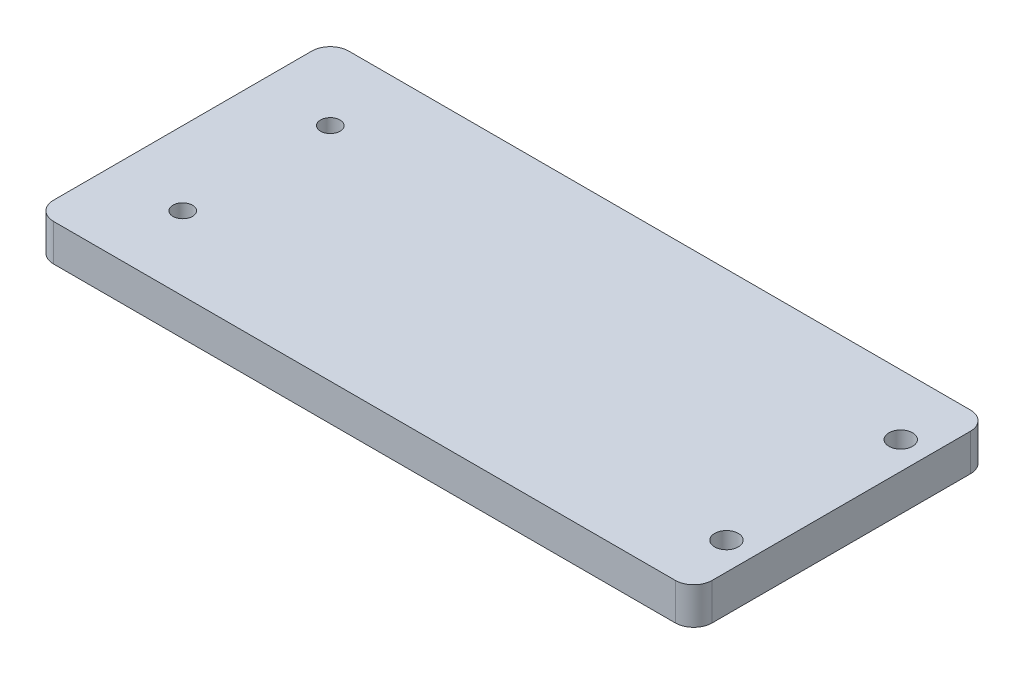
ISO-10303-21;
HEADER;
FILE_DESCRIPTION(('STEP AP214'),'2;1');
FILE_NAME('part.step','',(''),(''),'','','');
FILE_SCHEMA(('AUTOMOTIVE_DESIGN { 1 0 10303 214 1 1 1 1 }'));
ENDSEC;
DATA;
#1=APPLICATION_CONTEXT('core data for automotive mechanical design processes');
#2=APPLICATION_PROTOCOL_DEFINITION('international standard','automotive_design',2000,#1);
#3=PRODUCT_CONTEXT('',#1,'mechanical');
#4=PRODUCT('Part','Part','',(#3));
#5=PRODUCT_RELATED_PRODUCT_CATEGORY('part','',(#4));
#6=PRODUCT_DEFINITION_FORMATION('','',#4);
#7=PRODUCT_DEFINITION_CONTEXT('part definition',#1,'design');
#8=PRODUCT_DEFINITION('design','',#6,#7);
#9=PRODUCT_DEFINITION_SHAPE('','',#8);
#10=(LENGTH_UNIT() NAMED_UNIT(*) SI_UNIT(.MILLI.,.METRE.));
#11=(NAMED_UNIT(*) PLANE_ANGLE_UNIT() SI_UNIT($,.RADIAN.));
#12=(NAMED_UNIT(*) SI_UNIT($,.STERADIAN.) SOLID_ANGLE_UNIT());
#13=UNCERTAINTY_MEASURE_WITH_UNIT(LENGTH_MEASURE(1.E-05),#10,'distance_accuracy_value','');
#14=(GEOMETRIC_REPRESENTATION_CONTEXT(3) GLOBAL_UNCERTAINTY_ASSIGNED_CONTEXT((#13)) GLOBAL_UNIT_ASSIGNED_CONTEXT((#10,
#11,#12)) REPRESENTATION_CONTEXT('',''));
#15=CARTESIAN_POINT('',(0.,0.,0.));
#16=DIRECTION('',(0.,0.,1.));
#17=DIRECTION('',(1.,0.,0.));
#18=AXIS2_PLACEMENT_3D('',#15,#16,#17);
#19=CARTESIAN_POINT('',(0.,-12.6999999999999,0.));
#20=DIRECTION('',(-1.00000000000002,0.,0.));
#21=DIRECTION('',(0.,0.,1.));
#22=AXIS2_PLACEMENT_3D('',#19,#20,#21);
#23=PLANE('',#22);
#24=DIRECTION('',(0.,0.,1.));
#25=VECTOR('',#24,1.);
#26=CARTESIAN_POINT('',(0.,-12.6999999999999,0.));
#27=LINE('',#26,#25);
#28=CARTESIAN_POINT('',(0.,-12.6999999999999,-95.2500000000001));
#29=VERTEX_POINT('',#28);
#30=CARTESIAN_POINT('',(0.,-12.6999999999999,-6.35000000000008));
#31=VERTEX_POINT('',#30);
#32=EDGE_CURVE('E156',#29,#31,#27,.T.);
#33=ORIENTED_EDGE('',*,*,#32,.T.);
#34=DIRECTION('',(0.,0.999999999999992,0.));
#35=VECTOR('',#34,1.);
#36=CARTESIAN_POINT('',(0.,-12.6999999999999,-6.35000000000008));
#37=LINE('',#36,#35);
#38=CARTESIAN_POINT('',(0.,0.,-6.35000000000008));
#39=VERTEX_POINT('',#38);
#40=EDGE_CURVE('E11',#31,#39,#37,.T.);
#41=ORIENTED_EDGE('',*,*,#40,.T.);
#42=DIRECTION('',(0.,0.,1.));
#43=VECTOR('',#42,1.);
#44=CARTESIAN_POINT('',(0.,0.,0.));
#45=LINE('',#44,#43);
#46=CARTESIAN_POINT('',(0.,0.,-95.2500000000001));
#47=VERTEX_POINT('',#46);
#48=EDGE_CURVE('E106',#47,#39,#45,.T.);
#49=ORIENTED_EDGE('',*,*,#48,.F.);
#50=DIRECTION('',(0.,0.999999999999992,0.));
#51=VECTOR('',#50,1.);
#52=CARTESIAN_POINT('',(0.,-12.6999999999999,-95.2500000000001));
#53=LINE('',#52,#51);
#54=EDGE_CURVE('E42',#47,#29,#53,.F.);
#55=ORIENTED_EDGE('',*,*,#54,.T.);
#56=EDGE_LOOP('',(#33,#41,#49,#55));
#57=FACE_BOUND('',#56,.T.);
#58=ADVANCED_FACE('F34',(#57),#23,.T.);
#59=CARTESIAN_POINT('',(0.,-12.6999999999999,-101.6));
#60=DIRECTION('',(0.,0.,-1.));
#61=DIRECTION('',(-1.00000000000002,0.,0.));
#62=AXIS2_PLACEMENT_3D('',#59,#60,#61);
#63=PLANE('',#62);
#64=DIRECTION('',(-1.00000000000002,0.,0.));
#65=VECTOR('',#64,1.);
#66=CARTESIAN_POINT('',(0.,0.,-101.6));
#67=LINE('',#66,#65);
#68=CARTESIAN_POINT('',(220.370400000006,0.,-101.6));
#69=VERTEX_POINT('',#68);
#70=CARTESIAN_POINT('',(6.34999999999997,0.,-101.6));
#71=VERTEX_POINT('',#70);
#72=EDGE_CURVE('E132',#69,#71,#67,.T.);
#73=ORIENTED_EDGE('',*,*,#72,.F.);
#74=DIRECTION('',(0.,0.999999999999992,0.));
#75=VECTOR('',#74,1.);
#76=CARTESIAN_POINT('',(220.370400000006,-12.6999999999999,-101.6));
#77=LINE('',#76,#75);
#78=CARTESIAN_POINT('',(220.370400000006,-12.6999999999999,-101.6));
#79=VERTEX_POINT('',#78);
#80=EDGE_CURVE('E56',#69,#79,#77,.F.);
#81=ORIENTED_EDGE('',*,*,#80,.T.);
#82=DIRECTION('',(-1.00000000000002,0.,0.));
#83=VECTOR('',#82,1.);
#84=CARTESIAN_POINT('',(0.,-12.6999999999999,-101.6));
#85=LINE('',#84,#83);
#86=CARTESIAN_POINT('',(6.34999999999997,-12.6999999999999,-101.6));
#87=VERTEX_POINT('',#86);
#88=EDGE_CURVE('E126',#79,#87,#85,.T.);
#89=ORIENTED_EDGE('',*,*,#88,.T.);
#90=DIRECTION('',(0.,0.999999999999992,0.));
#91=VECTOR('',#90,1.);
#92=CARTESIAN_POINT('',(6.34999999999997,-12.6999999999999,-101.6));
#93=LINE('',#92,#91);
#94=EDGE_CURVE('E150',#87,#71,#93,.T.);
#95=ORIENTED_EDGE('',*,*,#94,.T.);
#96=EDGE_LOOP('',(#73,#81,#89,#95));
#97=FACE_BOUND('',#96,.T.);
#98=ADVANCED_FACE('F164',(#97),#63,.T.);
#99=CARTESIAN_POINT('',(226.720400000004,-12.6999999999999,0.));
#100=DIRECTION('',(1.00000000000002,0.,0.));
#101=DIRECTION('',(0.,0.,-1.));
#102=AXIS2_PLACEMENT_3D('',#99,#100,#101);
#103=PLANE('',#102);
#104=DIRECTION('',(0.,0.,-1.));
#105=VECTOR('',#104,1.);
#106=CARTESIAN_POINT('',(226.720400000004,0.,0.));
#107=LINE('',#106,#105);
#108=CARTESIAN_POINT('',(226.720400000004,0.,-6.35000000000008));
#109=VERTEX_POINT('',#108);
#110=CARTESIAN_POINT('',(226.720400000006,0.,-95.2500000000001));
#111=VERTEX_POINT('',#110);
#112=EDGE_CURVE('E121',#109,#111,#107,.T.);
#113=ORIENTED_EDGE('',*,*,#112,.F.);
#114=DIRECTION('',(0.,0.999999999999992,0.));
#115=VECTOR('',#114,1.);
#116=CARTESIAN_POINT('',(226.720400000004,-12.6999999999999,-6.35000000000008));
#117=LINE('',#116,#115);
#118=CARTESIAN_POINT('',(226.720400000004,-12.6999999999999,-6.35000000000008));
#119=VERTEX_POINT('',#118);
#120=EDGE_CURVE('E142',#109,#119,#117,.F.);
#121=ORIENTED_EDGE('',*,*,#120,.T.);
#122=DIRECTION('',(0.,0.,-1.));
#123=VECTOR('',#122,1.);
#124=CARTESIAN_POINT('',(226.720400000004,-12.6999999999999,0.));
#125=LINE('',#124,#123);
#126=CARTESIAN_POINT('',(226.720400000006,-12.6999999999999,-95.2500000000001));
#127=VERTEX_POINT('',#126);
#128=EDGE_CURVE('E129',#119,#127,#125,.T.);
#129=ORIENTED_EDGE('',*,*,#128,.T.);
#130=DIRECTION('',(0.,0.999999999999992,0.));
#131=VECTOR('',#130,1.);
#132=CARTESIAN_POINT('',(226.720400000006,-12.6999999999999,-95.2500000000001));
#133=LINE('',#132,#131);
#134=EDGE_CURVE('E139',#127,#111,#133,.T.);
#135=ORIENTED_EDGE('',*,*,#134,.T.);
#136=EDGE_LOOP('',(#113,#121,#129,#135));
#137=FACE_BOUND('',#136,.T.);
#138=ADVANCED_FACE('F233',(#137),#103,.T.);
#139=CARTESIAN_POINT('',(0.,-12.6999999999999,0.));
#140=DIRECTION('',(0.,0.,1.));
#141=DIRECTION('',(1.00000000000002,0.,0.));
#142=AXIS2_PLACEMENT_3D('',#139,#140,#141);
#143=PLANE('',#142);
#144=DIRECTION('',(1.00000000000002,0.,0.));
#145=VECTOR('',#144,1.);
#146=CARTESIAN_POINT('',(0.,-12.6999999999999,0.));
#147=LINE('',#146,#145);
#148=CARTESIAN_POINT('',(6.34999999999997,-12.6999999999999,0.));
#149=VERTEX_POINT('',#148);
#150=CARTESIAN_POINT('',(220.370400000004,-12.6999999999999,0.));
#151=VERTEX_POINT('',#150);
#152=EDGE_CURVE('E160',#149,#151,#147,.T.);
#153=ORIENTED_EDGE('',*,*,#152,.T.);
#154=DIRECTION('',(0.,0.999999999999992,0.));
#155=VECTOR('',#154,1.);
#156=CARTESIAN_POINT('',(220.370400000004,-12.6999999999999,0.));
#157=LINE('',#156,#155);
#158=CARTESIAN_POINT('',(220.370400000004,0.,0.));
#159=VERTEX_POINT('',#158);
#160=EDGE_CURVE('E120',#151,#159,#157,.T.);
#161=ORIENTED_EDGE('',*,*,#160,.T.);
#162=DIRECTION('',(1.00000000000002,0.,0.));
#163=VECTOR('',#162,1.);
#164=CARTESIAN_POINT('',(0.,0.,0.));
#165=LINE('',#164,#163);
#166=CARTESIAN_POINT('',(6.34999999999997,0.,0.));
#167=VERTEX_POINT('',#166);
#168=EDGE_CURVE('E104',#167,#159,#165,.T.);
#169=ORIENTED_EDGE('',*,*,#168,.F.);
#170=DIRECTION('',(0.,0.999999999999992,0.));
#171=VECTOR('',#170,1.);
#172=CARTESIAN_POINT('',(6.34999999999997,-12.6999999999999,0.));
#173=LINE('',#172,#171);
#174=EDGE_CURVE('E117',#167,#149,#173,.F.);
#175=ORIENTED_EDGE('',*,*,#174,.T.);
#176=EDGE_LOOP('',(#153,#161,#169,#175));
#177=FACE_BOUND('',#176,.T.);
#178=ADVANCED_FACE('F116',(#177),#143,.T.);
#179=CARTESIAN_POINT('',(0.,-12.6999999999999,-101.6));
#180=DIRECTION('',(0.,-0.999999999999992,0.));
#181=DIRECTION('',(0.,0.,-1.));
#182=AXIS2_PLACEMENT_3D('',#179,#180,#181);
#183=PLANE('',#182);
#184=CARTESIAN_POINT('',(217.195400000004,-12.6999999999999,-20.8025999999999));
#185=DIRECTION('',(0.,0.999999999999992,0.));
#186=DIRECTION('',(0.,0.,1.));
#187=AXIS2_PLACEMENT_3D('',#184,#185,#186);
#188=CIRCLE('',#187,4.06400000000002);
#189=CARTESIAN_POINT('',(217.195400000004,-12.6999999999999,-16.7385999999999));
#190=VERTEX_POINT('',#189);
#191=EDGE_CURVE('E188',#190,#190,#188,.T.);
#192=ORIENTED_EDGE('',*,*,#191,.T.);
#193=EDGE_LOOP('',(#192));
#194=FACE_BOUND('',#193,.T.);
#195=CARTESIAN_POINT('',(217.195400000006,-12.6999999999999,-80.7974));
#196=DIRECTION('',(0.,0.999999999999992,0.));
#197=DIRECTION('',(0.,0.,1.));
#198=AXIS2_PLACEMENT_3D('',#195,#196,#197);
#199=CIRCLE('',#198,4.06400000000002);
#200=CARTESIAN_POINT('',(217.195400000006,-12.6999999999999,-76.7334));
#201=VERTEX_POINT('',#200);
#202=EDGE_CURVE('E182',#201,#201,#199,.T.);
#203=ORIENTED_EDGE('',*,*,#202,.T.);
#204=EDGE_LOOP('',(#203));
#205=FACE_BOUND('',#204,.T.);
#206=CARTESIAN_POINT('',(25.400000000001,-12.6999999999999,-25.4000000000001));
#207=DIRECTION('',(0.,0.999999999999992,0.));
#208=DIRECTION('',(0.,0.,1.));
#209=AXIS2_PLACEMENT_3D('',#206,#207,#208);
#210=CIRCLE('',#209,3.3655);
#211=CARTESIAN_POINT('',(25.400000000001,-12.6999999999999,-22.0345000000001));
#212=VERTEX_POINT('',#211);
#213=EDGE_CURVE('E176',#212,#212,#210,.T.);
#214=ORIENTED_EDGE('',*,*,#213,.T.);
#215=EDGE_LOOP('',(#214));
#216=FACE_BOUND('',#215,.T.);
#217=CARTESIAN_POINT('',(25.400000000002,-12.6999999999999,-76.2));
#218=DIRECTION('',(0.,0.999999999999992,0.));
#219=DIRECTION('',(0.,0.,1.));
#220=AXIS2_PLACEMENT_3D('',#217,#218,#219);
#221=CIRCLE('',#220,3.3655);
#222=CARTESIAN_POINT('',(25.400000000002,-12.6999999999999,-72.8345));
#223=VERTEX_POINT('',#222);
#224=EDGE_CURVE('E168',#223,#223,#221,.T.);
#225=ORIENTED_EDGE('',*,*,#224,.T.);
#226=EDGE_LOOP('',(#225));
#227=FACE_BOUND('',#226,.T.);
#228=ORIENTED_EDGE('',*,*,#128,.F.);
#229=CARTESIAN_POINT('',(220.370400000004,-12.6999999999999,-6.35000000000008));
#230=DIRECTION('',(0.,-0.999999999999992,0.));
#231=DIRECTION('',(0.,0.,-1.));
#232=AXIS2_PLACEMENT_3D('',#229,#230,#231);
#233=CIRCLE('',#232,6.35);
#234=EDGE_CURVE('E148',#119,#151,#233,.T.);
#235=ORIENTED_EDGE('',*,*,#234,.T.);
#236=ORIENTED_EDGE('',*,*,#152,.F.);
#237=CARTESIAN_POINT('',(6.34999999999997,-12.6999999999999,-6.35000000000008));
#238=DIRECTION('',(0.,-0.999999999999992,0.));
#239=DIRECTION('',(0.,0.,-1.));
#240=AXIS2_PLACEMENT_3D('',#237,#238,#239);
#241=CIRCLE('',#240,6.35);
#242=EDGE_CURVE('E125',#149,#31,#241,.T.);
#243=ORIENTED_EDGE('',*,*,#242,.T.);
#244=ORIENTED_EDGE('',*,*,#32,.F.);
#245=CARTESIAN_POINT('',(6.34999999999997,-12.6999999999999,-95.2500000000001));
#246=DIRECTION('',(0.,-0.999999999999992,0.));
#247=DIRECTION('',(0.,0.,-1.));
#248=AXIS2_PLACEMENT_3D('',#245,#246,#247);
#249=CIRCLE('',#248,6.35);
#250=EDGE_CURVE('E49',#29,#87,#249,.T.);
#251=ORIENTED_EDGE('',*,*,#250,.T.);
#252=ORIENTED_EDGE('',*,*,#88,.F.);
#253=CARTESIAN_POINT('',(220.370400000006,-12.6999999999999,-95.2500000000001));
#254=DIRECTION('',(0.,-0.999999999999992,0.));
#255=DIRECTION('',(0.,0.,-1.));
#256=AXIS2_PLACEMENT_3D('',#253,#254,#255);
#257=CIRCLE('',#256,6.35);
#258=EDGE_CURVE('E146',#79,#127,#257,.T.);
#259=ORIENTED_EDGE('',*,*,#258,.T.);
#260=EDGE_LOOP('',(#228,#235,#236,#243,#244,#251,#252,#259));
#261=FACE_BOUND('',#260,.T.);
#262=ADVANCED_FACE('F159',(#194,#205,#216,#227,#261),#183,.T.);
#263=CARTESIAN_POINT('',(0.,0.,-101.6));
#264=DIRECTION('',(0.,-0.999999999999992,0.));
#265=DIRECTION('',(0.,0.,-1.));
#266=AXIS2_PLACEMENT_3D('',#263,#264,#265);
#267=PLANE('',#266);
#268=CARTESIAN_POINT('',(217.195400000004,0.,-20.8025999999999));
#269=DIRECTION('',(0.,0.999999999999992,0.));
#270=DIRECTION('',(0.,0.,1.));
#271=AXIS2_PLACEMENT_3D('',#268,#269,#270);
#272=CIRCLE('',#271,4.06400000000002);
#273=CARTESIAN_POINT('',(217.195400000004,0.,-16.7385999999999));
#274=VERTEX_POINT('',#273);
#275=EDGE_CURVE('E191',#274,#274,#272,.T.);
#276=ORIENTED_EDGE('',*,*,#275,.F.);
#277=EDGE_LOOP('',(#276));
#278=FACE_BOUND('',#277,.T.);
#279=CARTESIAN_POINT('',(217.195400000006,0.,-80.7974));
#280=DIRECTION('',(0.,0.999999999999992,0.));
#281=DIRECTION('',(0.,0.,1.));
#282=AXIS2_PLACEMENT_3D('',#279,#280,#281);
#283=CIRCLE('',#282,4.06400000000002);
#284=CARTESIAN_POINT('',(217.195400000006,0.,-76.7334));
#285=VERTEX_POINT('',#284);
#286=EDGE_CURVE('E185',#285,#285,#283,.T.);
#287=ORIENTED_EDGE('',*,*,#286,.F.);
#288=EDGE_LOOP('',(#287));
#289=FACE_BOUND('',#288,.T.);
#290=CARTESIAN_POINT('',(25.400000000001,0.,-25.4000000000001));
#291=DIRECTION('',(0.,0.999999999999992,0.));
#292=DIRECTION('',(0.,0.,1.));
#293=AXIS2_PLACEMENT_3D('',#290,#291,#292);
#294=CIRCLE('',#293,3.3655);
#295=CARTESIAN_POINT('',(25.400000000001,0.,-22.0345000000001));
#296=VERTEX_POINT('',#295);
#297=EDGE_CURVE('E179',#296,#296,#294,.T.);
#298=ORIENTED_EDGE('',*,*,#297,.F.);
#299=EDGE_LOOP('',(#298));
#300=FACE_BOUND('',#299,.T.);
#301=CARTESIAN_POINT('',(25.400000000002,0.,-76.2));
#302=DIRECTION('',(0.,0.999999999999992,0.));
#303=DIRECTION('',(0.,0.,1.));
#304=AXIS2_PLACEMENT_3D('',#301,#302,#303);
#305=CIRCLE('',#304,3.3655);
#306=CARTESIAN_POINT('',(25.400000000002,0.,-72.8345));
#307=VERTEX_POINT('',#306);
#308=EDGE_CURVE('E173',#307,#307,#305,.T.);
#309=ORIENTED_EDGE('',*,*,#308,.F.);
#310=EDGE_LOOP('',(#309));
#311=FACE_BOUND('',#310,.T.);
#312=ORIENTED_EDGE('',*,*,#168,.T.);
#313=CARTESIAN_POINT('',(220.370400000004,0.,-6.35000000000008));
#314=DIRECTION('',(0.,-0.999999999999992,0.));
#315=DIRECTION('',(0.,0.,-1.));
#316=AXIS2_PLACEMENT_3D('',#313,#314,#315);
#317=CIRCLE('',#316,6.35);
#318=EDGE_CURVE('E137',#159,#109,#317,.F.);
#319=ORIENTED_EDGE('',*,*,#318,.T.);
#320=ORIENTED_EDGE('',*,*,#112,.T.);
#321=CARTESIAN_POINT('',(220.370400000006,0.,-95.2500000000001));
#322=DIRECTION('',(0.,-0.999999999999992,0.));
#323=DIRECTION('',(0.,0.,-1.));
#324=AXIS2_PLACEMENT_3D('',#321,#322,#323);
#325=CIRCLE('',#324,6.35);
#326=EDGE_CURVE('E110',#111,#69,#325,.F.);
#327=ORIENTED_EDGE('',*,*,#326,.T.);
#328=ORIENTED_EDGE('',*,*,#72,.T.);
#329=CARTESIAN_POINT('',(6.34999999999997,0.,-95.2500000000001));
#330=DIRECTION('',(0.,-0.999999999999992,0.));
#331=DIRECTION('',(0.,0.,-1.));
#332=AXIS2_PLACEMENT_3D('',#329,#330,#331);
#333=CIRCLE('',#332,6.35);
#334=EDGE_CURVE('E111',#71,#47,#333,.F.);
#335=ORIENTED_EDGE('',*,*,#334,.T.);
#336=ORIENTED_EDGE('',*,*,#48,.T.);
#337=CARTESIAN_POINT('',(6.34999999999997,0.,-6.35000000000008));
#338=DIRECTION('',(0.,-0.999999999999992,0.));
#339=DIRECTION('',(0.,0.,-1.));
#340=AXIS2_PLACEMENT_3D('',#337,#338,#339);
#341=CIRCLE('',#340,6.35);
#342=EDGE_CURVE('E101',#39,#167,#341,.F.);
#343=ORIENTED_EDGE('',*,*,#342,.T.);
#344=EDGE_LOOP('',(#312,#319,#320,#327,#328,#335,#336,#343));
#345=FACE_BOUND('',#344,.T.);
#346=ADVANCED_FACE('F103',(#278,#289,#300,#311,#345),#267,.F.);
#347=CARTESIAN_POINT('',(25.400000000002,-12.6999999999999,-76.2));
#348=DIRECTION('',(0.,0.999999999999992,0.));
#349=DIRECTION('',(0.,0.,1.));
#350=AXIS2_PLACEMENT_3D('',#347,#348,#349);
#351=CYLINDRICAL_SURFACE('',#350,3.3655);
#352=CARTESIAN_POINT('',(25.400000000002,-12.6999999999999,-72.8345));
#353=CARTESIAN_POINT('',(25.400000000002,-12.5677083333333,-72.8345));
#354=CARTESIAN_POINT('',(25.400000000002,-12.4354166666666,-72.8345));
#355=CARTESIAN_POINT('',(25.400000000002,-12.1708333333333,-72.8345));
#356=CARTESIAN_POINT('',(25.400000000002,-12.0385416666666,-72.8345));
#357=CARTESIAN_POINT('',(25.400000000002,-11.7739583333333,-72.8345));
#358=CARTESIAN_POINT('',(25.400000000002,-11.6416666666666,-72.8345));
#359=CARTESIAN_POINT('',(25.400000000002,-11.3770833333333,-72.8345));
#360=CARTESIAN_POINT('',(25.400000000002,-11.2447916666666,-72.8345));
#361=CARTESIAN_POINT('',(25.400000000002,-10.9802083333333,-72.8345));
#362=CARTESIAN_POINT('',(25.400000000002,-10.8479166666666,-72.8345));
#363=CARTESIAN_POINT('',(25.400000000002,-10.5833333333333,-72.8345));
#364=CARTESIAN_POINT('',(25.400000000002,-10.4510416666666,-72.8345));
#365=CARTESIAN_POINT('',(25.400000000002,-10.1864583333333,-72.8345));
#366=CARTESIAN_POINT('',(25.400000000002,-10.0541666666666,-72.8345));
#367=CARTESIAN_POINT('',(25.400000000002,-9.78958333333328,-72.8345));
#368=CARTESIAN_POINT('',(25.400000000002,-9.65729166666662,-72.8345));
#369=CARTESIAN_POINT('',(25.400000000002,-9.39270833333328,-72.8345));
#370=CARTESIAN_POINT('',(25.400000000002,-9.26041666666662,-72.8345));
#371=CARTESIAN_POINT('',(25.400000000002,-8.99583333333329,-72.8345));
#372=CARTESIAN_POINT('',(25.400000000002,-8.86354166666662,-72.8345));
#373=CARTESIAN_POINT('',(25.400000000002,-8.59895833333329,-72.8345));
#374=CARTESIAN_POINT('',(25.400000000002,-8.46666666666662,-72.8345));
#375=CARTESIAN_POINT('',(25.400000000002,-8.20208333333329,-72.8345));
#376=CARTESIAN_POINT('',(25.400000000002,-8.06979166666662,-72.8345));
#377=CARTESIAN_POINT('',(25.400000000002,-7.80520833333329,-72.8345));
#378=CARTESIAN_POINT('',(25.400000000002,-7.67291666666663,-72.8345));
#379=CARTESIAN_POINT('',(25.400000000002,-7.40833333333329,-72.8345));
#380=CARTESIAN_POINT('',(25.400000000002,-7.27604166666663,-72.8345));
#381=CARTESIAN_POINT('',(25.400000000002,-7.01145833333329,-72.8345));
#382=CARTESIAN_POINT('',(25.400000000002,-6.87916666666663,-72.8345));
#383=CARTESIAN_POINT('',(25.400000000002,-6.6145833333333,-72.8345));
#384=CARTESIAN_POINT('',(25.400000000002,-6.48229166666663,-72.8345));
#385=CARTESIAN_POINT('',(25.400000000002,-6.2177083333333,-72.8345));
#386=CARTESIAN_POINT('',(25.400000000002,-6.08541666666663,-72.8345));
#387=CARTESIAN_POINT('',(25.400000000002,-5.8208333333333,-72.8345));
#388=CARTESIAN_POINT('',(25.400000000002,-5.68854166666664,-72.8345));
#389=CARTESIAN_POINT('',(25.400000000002,-5.4239583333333,-72.8345));
#390=CARTESIAN_POINT('',(25.400000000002,-5.29166666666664,-72.8345));
#391=CARTESIAN_POINT('',(25.400000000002,-5.02708333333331,-72.8345));
#392=CARTESIAN_POINT('',(25.400000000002,-4.89479166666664,-72.8345));
#393=CARTESIAN_POINT('',(25.400000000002,-4.63020833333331,-72.8345));
#394=CARTESIAN_POINT('',(25.400000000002,-4.49791666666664,-72.8345));
#395=CARTESIAN_POINT('',(25.400000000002,-4.23333333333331,-72.8345));
#396=CARTESIAN_POINT('',(25.400000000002,-4.10104166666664,-72.8345));
#397=CARTESIAN_POINT('',(25.400000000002,-3.83645833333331,-72.8345));
#398=CARTESIAN_POINT('',(25.400000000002,-3.70416666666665,-72.8345));
#399=CARTESIAN_POINT('',(25.400000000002,-3.43958333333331,-72.8345));
#400=CARTESIAN_POINT('',(25.400000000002,-3.30729166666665,-72.8345));
#401=CARTESIAN_POINT('',(25.400000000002,-3.04270833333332,-72.8345));
#402=CARTESIAN_POINT('',(25.400000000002,-2.91041666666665,-72.8345));
#403=CARTESIAN_POINT('',(25.400000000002,-2.64583333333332,-72.8345));
#404=CARTESIAN_POINT('',(25.400000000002,-2.51354166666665,-72.8345));
#405=CARTESIAN_POINT('',(25.400000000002,-2.24895833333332,-72.8345));
#406=CARTESIAN_POINT('',(25.400000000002,-2.11666666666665,-72.8345));
#407=CARTESIAN_POINT('',(25.400000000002,-1.85208333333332,-72.8345));
#408=CARTESIAN_POINT('',(25.400000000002,-1.71979166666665,-72.8345));
#409=CARTESIAN_POINT('',(25.400000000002,-1.45520833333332,-72.8345));
#410=CARTESIAN_POINT('',(25.400000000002,-1.32291666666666,-72.8345));
#411=CARTESIAN_POINT('',(25.400000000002,-1.05833333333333,-72.8345));
#412=CARTESIAN_POINT('',(25.400000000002,-0.92604166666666,-72.8345));
#413=CARTESIAN_POINT('',(25.400000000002,-0.661458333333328,-72.8345));
#414=CARTESIAN_POINT('',(25.400000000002,-0.529166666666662,-72.8345));
#415=CARTESIAN_POINT('',(25.400000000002,-0.26458333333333,-72.8345));
#416=CARTESIAN_POINT('',(25.400000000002,-0.132291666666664,-72.8345));
#417=CARTESIAN_POINT('',(25.400000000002,0.,-72.8345));
#418=B_SPLINE_CURVE_WITH_KNOTS('',3,(#352,#353,#354,#355,#356,#357,#358,#359,#360,#361,#362,
#363,#364,#365,#366,#367,#368,#369,#370,#371,#372,#373,#374,#375,#376,#377,#378,#379,#380,#381,
#382,#383,#384,#385,#386,#387,#388,#389,#390,#391,#392,#393,#394,#395,#396,#397,#398,#399,#400,
#401,#402,#403,#404,#405,#406,#407,#408,#409,#410,#411,#412,#413,#414,#415,#416,#417),
.UNSPECIFIED.,.F.,.F.,(4,2,2,2,2,2,2,2,2,2,2,2,2,2,2,2,2,2,2,2,2,2,2,2,2,2,2,2,2,2,2,2,4),(0.,
0.396874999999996,0.793749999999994,1.19062499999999,1.58749999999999,1.98437499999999,
2.38124999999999,2.77812499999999,3.17499999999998,3.57187499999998,3.96874999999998,
4.36562499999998,4.76249999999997,5.15937499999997,5.55624999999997,5.95312499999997,
6.34999999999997,6.74687499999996,7.14374999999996,7.54062499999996,7.93749999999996,
8.33437499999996,8.73124999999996,9.12812499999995,9.52499999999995,9.92187499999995,
10.3187499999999,10.7156249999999,11.1124999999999,11.5093749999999,11.9062499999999,
12.3031249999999,12.6999999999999),.UNSPECIFIED.);
#419=EDGE_CURVE('BSEAM209',#223,#307,#418,.T.);
#420=ORIENTED_EDGE('',*,*,#224,.F.);
#421=ORIENTED_EDGE('',*,*,#308,.T.);
#422=ORIENTED_EDGE('',*,*,#419,.T.);
#423=ORIENTED_EDGE('',*,*,#419,.F.);
#424=EDGE_LOOP('',(#420,#422,#421,#423));
#425=FACE_BOUND('',#424,.T.);
#426=ADVANCED_FACE('F209',(#425),#351,.F.);
#427=CARTESIAN_POINT('',(25.400000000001,-12.6999999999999,-25.4000000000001));
#428=DIRECTION('',(0.,0.999999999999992,0.));
#429=DIRECTION('',(0.,0.,1.));
#430=AXIS2_PLACEMENT_3D('',#427,#428,#429);
#431=CYLINDRICAL_SURFACE('',#430,3.3655);
#432=CARTESIAN_POINT('',(25.400000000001,-12.6999999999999,-22.0345000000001));
#433=CARTESIAN_POINT('',(25.400000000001,-12.5677083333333,-22.0345000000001));
#434=CARTESIAN_POINT('',(25.400000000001,-12.4354166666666,-22.0345000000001));
#435=CARTESIAN_POINT('',(25.400000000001,-12.1708333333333,-22.0345000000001));
#436=CARTESIAN_POINT('',(25.400000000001,-12.0385416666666,-22.0345000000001));
#437=CARTESIAN_POINT('',(25.400000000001,-11.7739583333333,-22.0345000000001));
#438=CARTESIAN_POINT('',(25.400000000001,-11.6416666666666,-22.0345000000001));
#439=CARTESIAN_POINT('',(25.400000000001,-11.3770833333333,-22.0345000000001));
#440=CARTESIAN_POINT('',(25.400000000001,-11.2447916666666,-22.0345000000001));
#441=CARTESIAN_POINT('',(25.400000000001,-10.9802083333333,-22.0345000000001));
#442=CARTESIAN_POINT('',(25.400000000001,-10.8479166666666,-22.0345000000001));
#443=CARTESIAN_POINT('',(25.400000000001,-10.5833333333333,-22.0345000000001));
#444=CARTESIAN_POINT('',(25.400000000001,-10.4510416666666,-22.0345000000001));
#445=CARTESIAN_POINT('',(25.400000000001,-10.1864583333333,-22.0345000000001));
#446=CARTESIAN_POINT('',(25.400000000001,-10.0541666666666,-22.0345000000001));
#447=CARTESIAN_POINT('',(25.400000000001,-9.78958333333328,-22.0345000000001));
#448=CARTESIAN_POINT('',(25.400000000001,-9.65729166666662,-22.0345000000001));
#449=CARTESIAN_POINT('',(25.400000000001,-9.39270833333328,-22.0345000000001));
#450=CARTESIAN_POINT('',(25.400000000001,-9.26041666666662,-22.0345000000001));
#451=CARTESIAN_POINT('',(25.400000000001,-8.99583333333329,-22.0345000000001));
#452=CARTESIAN_POINT('',(25.400000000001,-8.86354166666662,-22.0345000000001));
#453=CARTESIAN_POINT('',(25.400000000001,-8.59895833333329,-22.0345000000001));
#454=CARTESIAN_POINT('',(25.400000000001,-8.46666666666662,-22.0345000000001));
#455=CARTESIAN_POINT('',(25.400000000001,-8.20208333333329,-22.0345000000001));
#456=CARTESIAN_POINT('',(25.400000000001,-8.06979166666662,-22.0345000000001));
#457=CARTESIAN_POINT('',(25.400000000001,-7.80520833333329,-22.0345000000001));
#458=CARTESIAN_POINT('',(25.400000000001,-7.67291666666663,-22.0345000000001));
#459=CARTESIAN_POINT('',(25.400000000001,-7.40833333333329,-22.0345000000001));
#460=CARTESIAN_POINT('',(25.400000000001,-7.27604166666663,-22.0345000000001));
#461=CARTESIAN_POINT('',(25.400000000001,-7.01145833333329,-22.0345000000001));
#462=CARTESIAN_POINT('',(25.400000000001,-6.87916666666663,-22.0345000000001));
#463=CARTESIAN_POINT('',(25.400000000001,-6.6145833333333,-22.0345000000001));
#464=CARTESIAN_POINT('',(25.400000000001,-6.48229166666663,-22.0345000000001));
#465=CARTESIAN_POINT('',(25.400000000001,-6.2177083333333,-22.0345000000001));
#466=CARTESIAN_POINT('',(25.400000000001,-6.08541666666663,-22.0345000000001));
#467=CARTESIAN_POINT('',(25.400000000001,-5.8208333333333,-22.0345000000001));
#468=CARTESIAN_POINT('',(25.400000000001,-5.68854166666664,-22.0345000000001));
#469=CARTESIAN_POINT('',(25.400000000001,-5.4239583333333,-22.0345000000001));
#470=CARTESIAN_POINT('',(25.400000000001,-5.29166666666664,-22.0345000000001));
#471=CARTESIAN_POINT('',(25.400000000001,-5.02708333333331,-22.0345000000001));
#472=CARTESIAN_POINT('',(25.400000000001,-4.89479166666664,-22.0345000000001));
#473=CARTESIAN_POINT('',(25.400000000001,-4.63020833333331,-22.0345000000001));
#474=CARTESIAN_POINT('',(25.400000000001,-4.49791666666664,-22.0345000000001));
#475=CARTESIAN_POINT('',(25.400000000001,-4.23333333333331,-22.0345000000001));
#476=CARTESIAN_POINT('',(25.400000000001,-4.10104166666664,-22.0345000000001));
#477=CARTESIAN_POINT('',(25.400000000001,-3.83645833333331,-22.0345000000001));
#478=CARTESIAN_POINT('',(25.400000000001,-3.70416666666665,-22.0345000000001));
#479=CARTESIAN_POINT('',(25.400000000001,-3.43958333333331,-22.0345000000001));
#480=CARTESIAN_POINT('',(25.400000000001,-3.30729166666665,-22.0345000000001));
#481=CARTESIAN_POINT('',(25.400000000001,-3.04270833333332,-22.0345000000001));
#482=CARTESIAN_POINT('',(25.400000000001,-2.91041666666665,-22.0345000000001));
#483=CARTESIAN_POINT('',(25.400000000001,-2.64583333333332,-22.0345000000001));
#484=CARTESIAN_POINT('',(25.400000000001,-2.51354166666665,-22.0345000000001));
#485=CARTESIAN_POINT('',(25.400000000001,-2.24895833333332,-22.0345000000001));
#486=CARTESIAN_POINT('',(25.400000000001,-2.11666666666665,-22.0345000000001));
#487=CARTESIAN_POINT('',(25.400000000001,-1.85208333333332,-22.0345000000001));
#488=CARTESIAN_POINT('',(25.400000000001,-1.71979166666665,-22.0345000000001));
#489=CARTESIAN_POINT('',(25.400000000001,-1.45520833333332,-22.0345000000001));
#490=CARTESIAN_POINT('',(25.400000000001,-1.32291666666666,-22.0345000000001));
#491=CARTESIAN_POINT('',(25.400000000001,-1.05833333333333,-22.0345000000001));
#492=CARTESIAN_POINT('',(25.400000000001,-0.92604166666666,-22.0345000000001));
#493=CARTESIAN_POINT('',(25.400000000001,-0.661458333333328,-22.0345000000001));
#494=CARTESIAN_POINT('',(25.400000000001,-0.529166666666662,-22.0345000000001));
#495=CARTESIAN_POINT('',(25.400000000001,-0.26458333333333,-22.0345000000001));
#496=CARTESIAN_POINT('',(25.400000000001,-0.132291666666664,-22.0345000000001));
#497=CARTESIAN_POINT('',(25.400000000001,0.,-22.0345000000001));
#498=B_SPLINE_CURVE_WITH_KNOTS('',3,(#432,#433,#434,#435,#436,#437,#438,#439,#440,#441,#442,
#443,#444,#445,#446,#447,#448,#449,#450,#451,#452,#453,#454,#455,#456,#457,#458,#459,#460,#461,
#462,#463,#464,#465,#466,#467,#468,#469,#470,#471,#472,#473,#474,#475,#476,#477,#478,#479,#480,
#481,#482,#483,#484,#485,#486,#487,#488,#489,#490,#491,#492,#493,#494,#495,#496,#497),
.UNSPECIFIED.,.F.,.F.,(4,2,2,2,2,2,2,2,2,2,2,2,2,2,2,2,2,2,2,2,2,2,2,2,2,2,2,2,2,2,2,2,4),(0.,
0.396874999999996,0.793749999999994,1.19062499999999,1.58749999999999,1.98437499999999,
2.38124999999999,2.77812499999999,3.17499999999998,3.57187499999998,3.96874999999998,
4.36562499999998,4.76249999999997,5.15937499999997,5.55624999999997,5.95312499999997,
6.34999999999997,6.74687499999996,7.14374999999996,7.54062499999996,7.93749999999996,
8.33437499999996,8.73124999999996,9.12812499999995,9.52499999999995,9.92187499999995,
10.3187499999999,10.7156249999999,11.1124999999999,11.5093749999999,11.9062499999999,
12.3031249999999,12.6999999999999),.UNSPECIFIED.);
#499=EDGE_CURVE('BSEAM218',#212,#296,#498,.T.);
#500=ORIENTED_EDGE('',*,*,#213,.F.);
#501=ORIENTED_EDGE('',*,*,#297,.T.);
#502=ORIENTED_EDGE('',*,*,#499,.T.);
#503=ORIENTED_EDGE('',*,*,#499,.F.);
#504=EDGE_LOOP('',(#500,#502,#501,#503));
#505=FACE_BOUND('',#504,.T.);
#506=ADVANCED_FACE('F218',(#505),#431,.F.);
#507=CARTESIAN_POINT('',(217.195400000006,-12.6999999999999,-80.7974));
#508=DIRECTION('',(0.,0.999999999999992,0.));
#509=DIRECTION('',(0.,0.,1.));
#510=AXIS2_PLACEMENT_3D('',#507,#508,#509);
#511=CYLINDRICAL_SURFACE('',#510,4.06400000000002);
#512=CARTESIAN_POINT('',(217.195400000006,-12.6999999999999,-76.7334));
#513=CARTESIAN_POINT('',(217.195400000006,-12.5677083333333,-76.7334));
#514=CARTESIAN_POINT('',(217.195400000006,-12.4354166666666,-76.7334));
#515=CARTESIAN_POINT('',(217.195400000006,-12.1708333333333,-76.7334));
#516=CARTESIAN_POINT('',(217.195400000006,-12.0385416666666,-76.7334));
#517=CARTESIAN_POINT('',(217.195400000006,-11.7739583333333,-76.7334));
#518=CARTESIAN_POINT('',(217.195400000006,-11.6416666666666,-76.7334));
#519=CARTESIAN_POINT('',(217.195400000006,-11.3770833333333,-76.7334));
#520=CARTESIAN_POINT('',(217.195400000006,-11.2447916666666,-76.7334));
#521=CARTESIAN_POINT('',(217.195400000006,-10.9802083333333,-76.7334));
#522=CARTESIAN_POINT('',(217.195400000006,-10.8479166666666,-76.7334));
#523=CARTESIAN_POINT('',(217.195400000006,-10.5833333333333,-76.7334));
#524=CARTESIAN_POINT('',(217.195400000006,-10.4510416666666,-76.7334));
#525=CARTESIAN_POINT('',(217.195400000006,-10.1864583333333,-76.7334));
#526=CARTESIAN_POINT('',(217.195400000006,-10.0541666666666,-76.7334));
#527=CARTESIAN_POINT('',(217.195400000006,-9.78958333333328,-76.7334));
#528=CARTESIAN_POINT('',(217.195400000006,-9.65729166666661,-76.7334));
#529=CARTESIAN_POINT('',(217.195400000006,-9.39270833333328,-76.7334));
#530=CARTESIAN_POINT('',(217.195400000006,-9.26041666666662,-76.7334));
#531=CARTESIAN_POINT('',(217.195400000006,-8.99583333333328,-76.7334));
#532=CARTESIAN_POINT('',(217.195400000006,-8.86354166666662,-76.7334));
#533=CARTESIAN_POINT('',(217.195400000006,-8.59895833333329,-76.7334));
#534=CARTESIAN_POINT('',(217.195400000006,-8.46666666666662,-76.7334));
#535=CARTESIAN_POINT('',(217.195400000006,-8.20208333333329,-76.7334));
#536=CARTESIAN_POINT('',(217.195400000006,-8.06979166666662,-76.7334));
#537=CARTESIAN_POINT('',(217.195400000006,-7.80520833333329,-76.7334));
#538=CARTESIAN_POINT('',(217.195400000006,-7.67291666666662,-76.7334));
#539=CARTESIAN_POINT('',(217.195400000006,-7.40833333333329,-76.7334));
#540=CARTESIAN_POINT('',(217.195400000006,-7.27604166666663,-76.7334));
#541=CARTESIAN_POINT('',(217.195400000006,-7.01145833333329,-76.7334));
#542=CARTESIAN_POINT('',(217.195400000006,-6.87916666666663,-76.7334));
#543=CARTESIAN_POINT('',(217.195400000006,-6.6145833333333,-76.7334));
#544=CARTESIAN_POINT('',(217.195400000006,-6.48229166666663,-76.7334));
#545=CARTESIAN_POINT('',(217.195400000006,-6.2177083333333,-76.7334));
#546=CARTESIAN_POINT('',(217.195400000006,-6.08541666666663,-76.7334));
#547=CARTESIAN_POINT('',(217.195400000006,-5.8208333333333,-76.7334));
#548=CARTESIAN_POINT('',(217.195400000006,-5.68854166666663,-76.7334));
#549=CARTESIAN_POINT('',(217.195400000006,-5.4239583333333,-76.7334));
#550=CARTESIAN_POINT('',(217.195400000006,-5.29166666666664,-76.7334));
#551=CARTESIAN_POINT('',(217.195400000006,-5.0270833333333,-76.7334));
#552=CARTESIAN_POINT('',(217.195400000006,-4.89479166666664,-76.7334));
#553=CARTESIAN_POINT('',(217.195400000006,-4.63020833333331,-76.7334));
#554=CARTESIAN_POINT('',(217.195400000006,-4.49791666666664,-76.7334));
#555=CARTESIAN_POINT('',(217.195400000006,-4.23333333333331,-76.7334));
#556=CARTESIAN_POINT('',(217.195400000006,-4.10104166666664,-76.7334));
#557=CARTESIAN_POINT('',(217.195400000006,-3.83645833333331,-76.7334));
#558=CARTESIAN_POINT('',(217.195400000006,-3.70416666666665,-76.7334));
#559=CARTESIAN_POINT('',(217.195400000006,-3.43958333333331,-76.7334));
#560=CARTESIAN_POINT('',(217.195400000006,-3.30729166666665,-76.7334));
#561=CARTESIAN_POINT('',(217.195400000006,-3.04270833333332,-76.7334));
#562=CARTESIAN_POINT('',(217.195400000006,-2.91041666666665,-76.7334));
#563=CARTESIAN_POINT('',(217.195400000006,-2.64583333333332,-76.7334));
#564=CARTESIAN_POINT('',(217.195400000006,-2.51354166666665,-76.7334));
#565=CARTESIAN_POINT('',(217.195400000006,-2.24895833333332,-76.7334));
#566=CARTESIAN_POINT('',(217.195400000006,-2.11666666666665,-76.7334));
#567=CARTESIAN_POINT('',(217.195400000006,-1.85208333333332,-76.7334));
#568=CARTESIAN_POINT('',(217.195400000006,-1.71979166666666,-76.7334));
#569=CARTESIAN_POINT('',(217.195400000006,-1.45520833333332,-76.7334));
#570=CARTESIAN_POINT('',(217.195400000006,-1.32291666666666,-76.7334));
#571=CARTESIAN_POINT('',(217.195400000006,-1.05833333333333,-76.7334));
#572=CARTESIAN_POINT('',(217.195400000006,-0.92604166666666,-76.7334));
#573=CARTESIAN_POINT('',(217.195400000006,-0.661458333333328,-76.7334));
#574=CARTESIAN_POINT('',(217.195400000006,-0.529166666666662,-76.7334));
#575=CARTESIAN_POINT('',(217.195400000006,-0.26458333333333,-76.7334));
#576=CARTESIAN_POINT('',(217.195400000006,-0.132291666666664,-76.7334));
#577=CARTESIAN_POINT('',(217.195400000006,0.,-76.7334));
#578=B_SPLINE_CURVE_WITH_KNOTS('',3,(#512,#513,#514,#515,#516,#517,#518,#519,#520,#521,#522,
#523,#524,#525,#526,#527,#528,#529,#530,#531,#532,#533,#534,#535,#536,#537,#538,#539,#540,#541,
#542,#543,#544,#545,#546,#547,#548,#549,#550,#551,#552,#553,#554,#555,#556,#557,#558,#559,#560,
#561,#562,#563,#564,#565,#566,#567,#568,#569,#570,#571,#572,#573,#574,#575,#576,#577),
.UNSPECIFIED.,.F.,.F.,(4,2,2,2,2,2,2,2,2,2,2,2,2,2,2,2,2,2,2,2,2,2,2,2,2,2,2,2,2,2,2,2,4),(0.,
0.396875,0.793749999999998,1.190625,1.58749999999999,1.98437499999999,2.38124999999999,
2.77812499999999,3.17499999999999,3.57187499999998,3.96874999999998,4.36562499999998,
4.76249999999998,5.15937499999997,5.55624999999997,5.95312499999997,6.34999999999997,
6.74687499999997,7.14374999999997,7.54062499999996,7.93749999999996,8.33437499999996,
8.73124999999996,9.12812499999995,9.52499999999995,9.92187499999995,10.3187499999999,
10.7156249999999,11.1124999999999,11.5093749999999,11.9062499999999,12.3031249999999,
12.6999999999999),.UNSPECIFIED.);
#579=EDGE_CURVE('BSEAM203',#201,#285,#578,.T.);
#580=ORIENTED_EDGE('',*,*,#202,.F.);
#581=ORIENTED_EDGE('',*,*,#286,.T.);
#582=ORIENTED_EDGE('',*,*,#579,.T.);
#583=ORIENTED_EDGE('',*,*,#579,.F.);
#584=EDGE_LOOP('',(#580,#582,#581,#583));
#585=FACE_BOUND('',#584,.T.);
#586=ADVANCED_FACE('F203',(#585),#511,.F.);
#587=CARTESIAN_POINT('',(217.195400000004,-12.6999999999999,-20.8025999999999));
#588=DIRECTION('',(0.,0.999999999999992,0.));
#589=DIRECTION('',(0.,0.,1.));
#590=AXIS2_PLACEMENT_3D('',#587,#588,#589);
#591=CYLINDRICAL_SURFACE('',#590,4.06400000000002);
#592=CARTESIAN_POINT('',(217.195400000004,-12.6999999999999,-16.7385999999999));
#593=CARTESIAN_POINT('',(217.195400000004,-12.5677083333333,-16.7385999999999));
#594=CARTESIAN_POINT('',(217.195400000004,-12.4354166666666,-16.7385999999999));
#595=CARTESIAN_POINT('',(217.195400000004,-12.1708333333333,-16.7385999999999));
#596=CARTESIAN_POINT('',(217.195400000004,-12.0385416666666,-16.7385999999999));
#597=CARTESIAN_POINT('',(217.195400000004,-11.7739583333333,-16.7385999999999));
#598=CARTESIAN_POINT('',(217.195400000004,-11.6416666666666,-16.7385999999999));
#599=CARTESIAN_POINT('',(217.195400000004,-11.3770833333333,-16.7385999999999));
#600=CARTESIAN_POINT('',(217.195400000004,-11.2447916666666,-16.7385999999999));
#601=CARTESIAN_POINT('',(217.195400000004,-10.9802083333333,-16.7385999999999));
#602=CARTESIAN_POINT('',(217.195400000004,-10.8479166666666,-16.7385999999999));
#603=CARTESIAN_POINT('',(217.195400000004,-10.5833333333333,-16.7385999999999));
#604=CARTESIAN_POINT('',(217.195400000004,-10.4510416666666,-16.7385999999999));
#605=CARTESIAN_POINT('',(217.195400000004,-10.1864583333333,-16.7385999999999));
#606=CARTESIAN_POINT('',(217.195400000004,-10.0541666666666,-16.7385999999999));
#607=CARTESIAN_POINT('',(217.195400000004,-9.78958333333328,-16.7385999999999));
#608=CARTESIAN_POINT('',(217.195400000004,-9.65729166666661,-16.7385999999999));
#609=CARTESIAN_POINT('',(217.195400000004,-9.39270833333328,-16.7385999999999));
#610=CARTESIAN_POINT('',(217.195400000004,-9.26041666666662,-16.7385999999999));
#611=CARTESIAN_POINT('',(217.195400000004,-8.99583333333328,-16.7385999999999));
#612=CARTESIAN_POINT('',(217.195400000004,-8.86354166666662,-16.7385999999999));
#613=CARTESIAN_POINT('',(217.195400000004,-8.59895833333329,-16.7385999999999));
#614=CARTESIAN_POINT('',(217.195400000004,-8.46666666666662,-16.7385999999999));
#615=CARTESIAN_POINT('',(217.195400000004,-8.20208333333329,-16.7385999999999));
#616=CARTESIAN_POINT('',(217.195400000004,-8.06979166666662,-16.7385999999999));
#617=CARTESIAN_POINT('',(217.195400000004,-7.80520833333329,-16.7385999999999));
#618=CARTESIAN_POINT('',(217.195400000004,-7.67291666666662,-16.7385999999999));
#619=CARTESIAN_POINT('',(217.195400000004,-7.40833333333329,-16.7385999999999));
#620=CARTESIAN_POINT('',(217.195400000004,-7.27604166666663,-16.7385999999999));
#621=CARTESIAN_POINT('',(217.195400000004,-7.01145833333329,-16.7385999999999));
#622=CARTESIAN_POINT('',(217.195400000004,-6.87916666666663,-16.7385999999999));
#623=CARTESIAN_POINT('',(217.195400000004,-6.6145833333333,-16.7385999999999));
#624=CARTESIAN_POINT('',(217.195400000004,-6.48229166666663,-16.7385999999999));
#625=CARTESIAN_POINT('',(217.195400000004,-6.2177083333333,-16.7385999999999));
#626=CARTESIAN_POINT('',(217.195400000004,-6.08541666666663,-16.7385999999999));
#627=CARTESIAN_POINT('',(217.195400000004,-5.8208333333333,-16.7385999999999));
#628=CARTESIAN_POINT('',(217.195400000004,-5.68854166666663,-16.7385999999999));
#629=CARTESIAN_POINT('',(217.195400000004,-5.4239583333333,-16.7385999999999));
#630=CARTESIAN_POINT('',(217.195400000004,-5.29166666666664,-16.7385999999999));
#631=CARTESIAN_POINT('',(217.195400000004,-5.0270833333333,-16.7385999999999));
#632=CARTESIAN_POINT('',(217.195400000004,-4.89479166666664,-16.7385999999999));
#633=CARTESIAN_POINT('',(217.195400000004,-4.63020833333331,-16.7385999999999));
#634=CARTESIAN_POINT('',(217.195400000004,-4.49791666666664,-16.7385999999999));
#635=CARTESIAN_POINT('',(217.195400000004,-4.23333333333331,-16.7385999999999));
#636=CARTESIAN_POINT('',(217.195400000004,-4.10104166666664,-16.7385999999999));
#637=CARTESIAN_POINT('',(217.195400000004,-3.83645833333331,-16.7385999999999));
#638=CARTESIAN_POINT('',(217.195400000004,-3.70416666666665,-16.7385999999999));
#639=CARTESIAN_POINT('',(217.195400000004,-3.43958333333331,-16.7385999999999));
#640=CARTESIAN_POINT('',(217.195400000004,-3.30729166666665,-16.7385999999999));
#641=CARTESIAN_POINT('',(217.195400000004,-3.04270833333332,-16.7385999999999));
#642=CARTESIAN_POINT('',(217.195400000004,-2.91041666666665,-16.7385999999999));
#643=CARTESIAN_POINT('',(217.195400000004,-2.64583333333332,-16.7385999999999));
#644=CARTESIAN_POINT('',(217.195400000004,-2.51354166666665,-16.7385999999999));
#645=CARTESIAN_POINT('',(217.195400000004,-2.24895833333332,-16.7385999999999));
#646=CARTESIAN_POINT('',(217.195400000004,-2.11666666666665,-16.7385999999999));
#647=CARTESIAN_POINT('',(217.195400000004,-1.85208333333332,-16.7385999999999));
#648=CARTESIAN_POINT('',(217.195400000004,-1.71979166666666,-16.7385999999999));
#649=CARTESIAN_POINT('',(217.195400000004,-1.45520833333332,-16.7385999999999));
#650=CARTESIAN_POINT('',(217.195400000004,-1.32291666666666,-16.7385999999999));
#651=CARTESIAN_POINT('',(217.195400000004,-1.05833333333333,-16.7385999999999));
#652=CARTESIAN_POINT('',(217.195400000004,-0.92604166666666,-16.7385999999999));
#653=CARTESIAN_POINT('',(217.195400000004,-0.661458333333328,-16.7385999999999));
#654=CARTESIAN_POINT('',(217.195400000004,-0.529166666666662,-16.7385999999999));
#655=CARTESIAN_POINT('',(217.195400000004,-0.26458333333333,-16.7385999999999));
#656=CARTESIAN_POINT('',(217.195400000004,-0.132291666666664,-16.7385999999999));
#657=CARTESIAN_POINT('',(217.195400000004,0.,-16.7385999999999));
#658=B_SPLINE_CURVE_WITH_KNOTS('',3,(#592,#593,#594,#595,#596,#597,#598,#599,#600,#601,#602,
#603,#604,#605,#606,#607,#608,#609,#610,#611,#612,#613,#614,#615,#616,#617,#618,#619,#620,#621,
#622,#623,#624,#625,#626,#627,#628,#629,#630,#631,#632,#633,#634,#635,#636,#637,#638,#639,#640,
#641,#642,#643,#644,#645,#646,#647,#648,#649,#650,#651,#652,#653,#654,#655,#656,#657),
.UNSPECIFIED.,.F.,.F.,(4,2,2,2,2,2,2,2,2,2,2,2,2,2,2,2,2,2,2,2,2,2,2,2,2,2,2,2,2,2,2,2,4),(0.,
0.396875,0.793749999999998,1.190625,1.58749999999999,1.98437499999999,2.38124999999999,
2.77812499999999,3.17499999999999,3.57187499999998,3.96874999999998,4.36562499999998,
4.76249999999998,5.15937499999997,5.55624999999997,5.95312499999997,6.34999999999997,
6.74687499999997,7.14374999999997,7.54062499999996,7.93749999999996,8.33437499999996,
8.73124999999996,9.12812499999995,9.52499999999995,9.92187499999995,10.3187499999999,
10.7156249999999,11.1124999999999,11.5093749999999,11.9062499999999,12.3031249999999,
12.6999999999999),.UNSPECIFIED.);
#659=EDGE_CURVE('BSEAM199',#190,#274,#658,.T.);
#660=ORIENTED_EDGE('',*,*,#191,.F.);
#661=ORIENTED_EDGE('',*,*,#275,.T.);
#662=ORIENTED_EDGE('',*,*,#659,.T.);
#663=ORIENTED_EDGE('',*,*,#659,.F.);
#664=EDGE_LOOP('',(#660,#662,#661,#663));
#665=FACE_BOUND('',#664,.T.);
#666=ADVANCED_FACE('F199',(#665),#591,.F.);
#667=CARTESIAN_POINT('',(220.370400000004,-12.6999999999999,-6.35000000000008));
#668=DIRECTION('',(0.,0.999999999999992,0.));
#669=DIRECTION('',(0.,0.,1.));
#670=AXIS2_PLACEMENT_3D('',#667,#668,#669);
#671=CYLINDRICAL_SURFACE('',#670,6.35);
#672=ORIENTED_EDGE('',*,*,#234,.F.);
#673=ORIENTED_EDGE('',*,*,#120,.F.);
#674=ORIENTED_EDGE('',*,*,#318,.F.);
#675=ORIENTED_EDGE('',*,*,#160,.F.);
#676=EDGE_LOOP('',(#672,#673,#674,#675));
#677=FACE_BOUND('',#676,.T.);
#678=ADVANCED_FACE('F202',(#677),#671,.T.);
#679=CARTESIAN_POINT('',(220.370400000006,-12.6999999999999,-95.2500000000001));
#680=DIRECTION('',(0.,0.999999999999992,0.));
#681=DIRECTION('',(0.,0.,1.));
#682=AXIS2_PLACEMENT_3D('',#679,#680,#681);
#683=CYLINDRICAL_SURFACE('',#682,6.35);
#684=ORIENTED_EDGE('',*,*,#258,.F.);
#685=ORIENTED_EDGE('',*,*,#80,.F.);
#686=ORIENTED_EDGE('',*,*,#326,.F.);
#687=ORIENTED_EDGE('',*,*,#134,.F.);
#688=EDGE_LOOP('',(#684,#685,#686,#687));
#689=FACE_BOUND('',#688,.T.);
#690=ADVANCED_FACE('F240',(#689),#683,.T.);
#691=CARTESIAN_POINT('',(6.34999999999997,-12.6999999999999,-6.35000000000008));
#692=DIRECTION('',(0.,0.999999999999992,0.));
#693=DIRECTION('',(0.,0.,1.));
#694=AXIS2_PLACEMENT_3D('',#691,#692,#693);
#695=CYLINDRICAL_SURFACE('',#694,6.35);
#696=ORIENTED_EDGE('',*,*,#242,.F.);
#697=ORIENTED_EDGE('',*,*,#174,.F.);
#698=ORIENTED_EDGE('',*,*,#342,.F.);
#699=ORIENTED_EDGE('',*,*,#40,.F.);
#700=EDGE_LOOP('',(#696,#697,#698,#699));
#701=FACE_BOUND('',#700,.T.);
#702=ADVANCED_FACE('F124',(#701),#695,.T.);
#703=CARTESIAN_POINT('',(6.34999999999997,-12.6999999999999,-95.2500000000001));
#704=DIRECTION('',(0.,0.999999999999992,0.));
#705=DIRECTION('',(0.,0.,1.));
#706=AXIS2_PLACEMENT_3D('',#703,#704,#705);
#707=CYLINDRICAL_SURFACE('',#706,6.35);
#708=ORIENTED_EDGE('',*,*,#250,.F.);
#709=ORIENTED_EDGE('',*,*,#54,.F.);
#710=ORIENTED_EDGE('',*,*,#334,.F.);
#711=ORIENTED_EDGE('',*,*,#94,.F.);
#712=EDGE_LOOP('',(#708,#709,#710,#711));
#713=FACE_BOUND('',#712,.T.);
#714=ADVANCED_FACE('F36',(#713),#707,.T.);
#715=CLOSED_SHELL('',(#58,#98,#138,#178,#262,#346,#426,#506,#586,#666,#678,#690,#702,#714));
#716=MANIFOLD_SOLID_BREP('B2',#715);
#717=ADVANCED_BREP_SHAPE_REPRESENTATION('',(#18,#716),#14);
#718=SHAPE_DEFINITION_REPRESENTATION(#9,#717);
ENDSEC;
END-ISO-10303-21;
